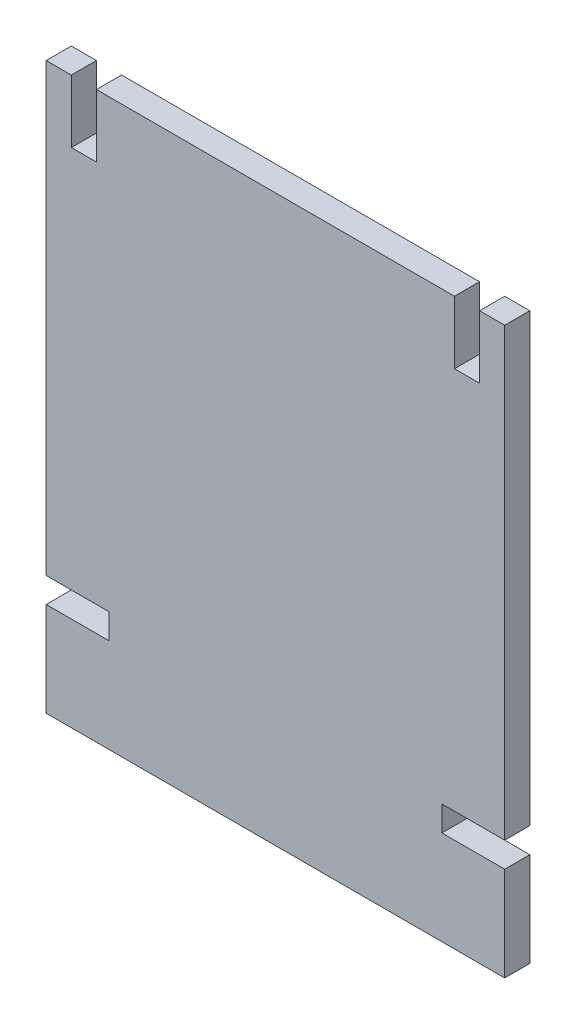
from build123d import *

# Parameters (mm, degrees)
EXTRUDE1_DEPTH = 4


with BuildPart() as part:
    # Sketch1 → Extrude1 (new body)
    with BuildSketch(Plane.XY):
        Polygon((-28.5, 45), (28.5, 45), (28.5, 35), (32.5, 35), (32.5, 45), (36.5, 45), (36.5, -26), (26.5, -26), (26.5, -30), (36.5, -30), (36.5, -45), (-36.5, -45), (-36.5, -30), (-26.5, -30), (-26.5, -26), (-36.5, -26), (-36.5, 45), (-32.5, 45), (-32.5, 35), (-28.5, 35), align=None)
    extrude(amount=EXTRUDE1_DEPTH)


solid = part.part
